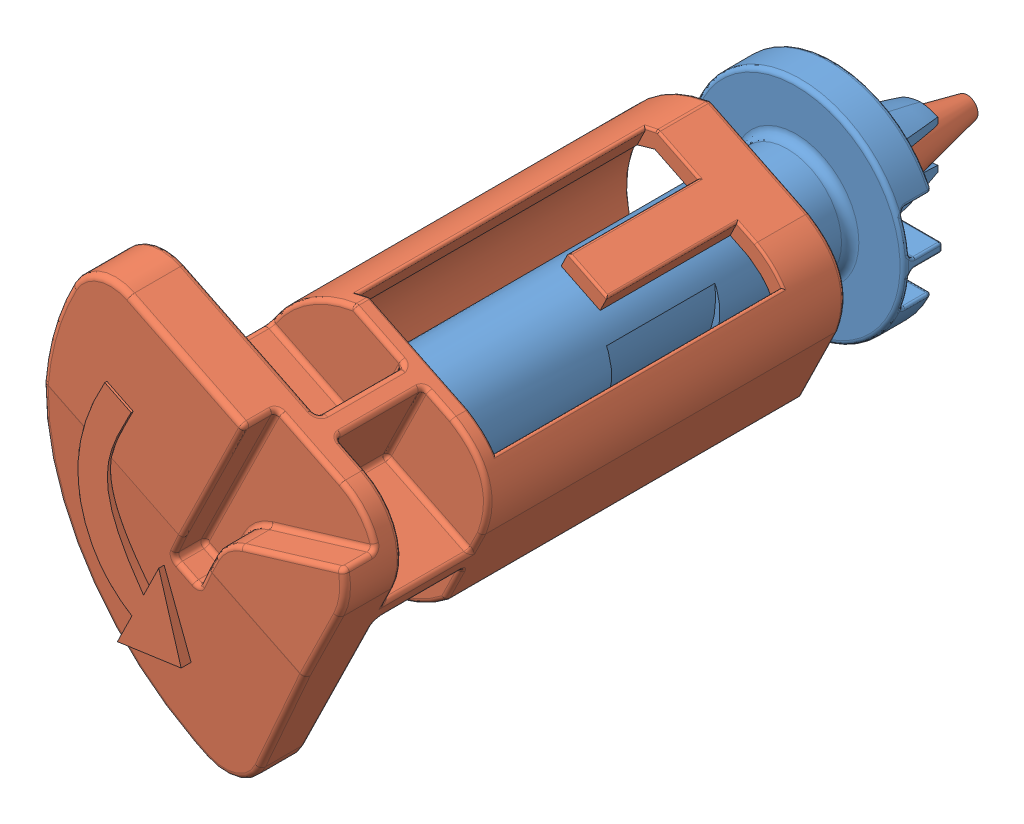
SolidWorks assembly jucna grampos.SLDASM, configuration Default (file format 10000). Lengths in mm.
Overall size (19.37 19.37 34.59).
2 component instances, 2 part files, 2 mates.
Components (placement in the parent):
- grampo parte branca-1: grampo parte branca.SLDPRT [Default] at (4.9934 13.6794 14.286) size (10.02 10 24.99)
- grampo preto-1: grampo preto.SLDPRT [Default] at (5.4033 3.1276 40.636) x (-0.440286 -0.897858 0) z (0 0 -1) size (14.48 14.48 34.59)
Mates (geometry in assembly coordinates):
- Concentric1: concentric aligned: cylinder of grampo parte branca-1 through (5.1386 13.8362 15.536) axis (0 0 1) radius 1.75; cylinder of grampo preto-1 through (5.1386 13.8362 6.536) axis (0 0 1) radius 1.35
- Coincident1: coincident anti-aligned: plane of grampo parte branca-1 through (4.9934 13.6794 33.536) normal (0 0 1); plane of grampo preto-1 through (5.4033 3.1276 33.536) normal (0 0 -1)
